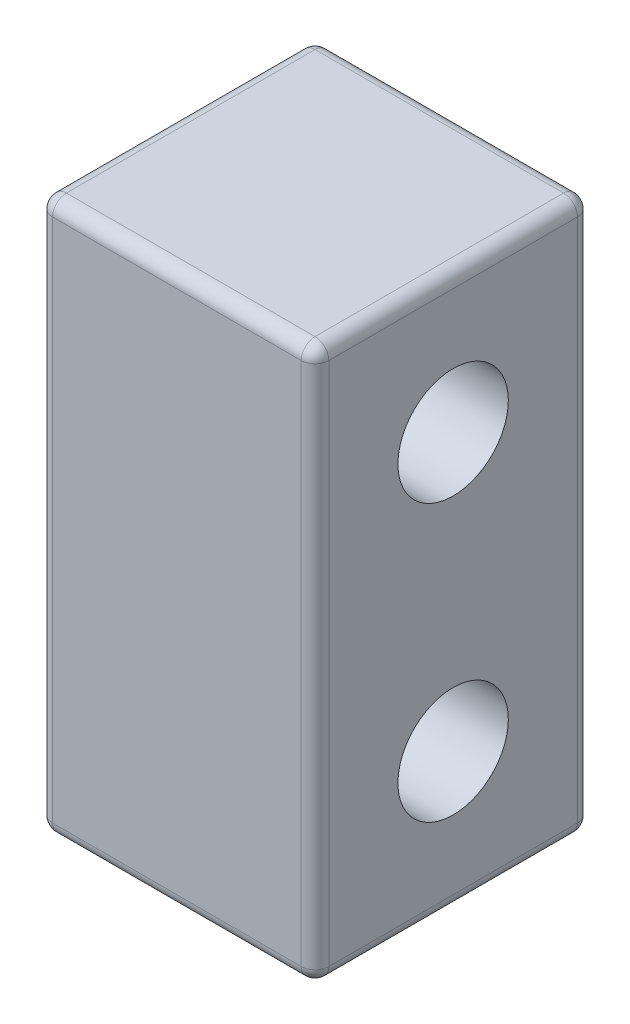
ISO-10303-21;
HEADER;
FILE_DESCRIPTION(('STEP AP214'),'2;1');
FILE_NAME('part.step','',(''),(''),'','','');
FILE_SCHEMA(('AUTOMOTIVE_DESIGN { 1 0 10303 214 1 1 1 1 }'));
ENDSEC;
DATA;
#1=APPLICATION_CONTEXT('core data for automotive mechanical design processes');
#2=APPLICATION_PROTOCOL_DEFINITION('international standard','automotive_design',2000,#1);
#3=PRODUCT_CONTEXT('',#1,'mechanical');
#4=PRODUCT('Part','Part','',(#3));
#5=PRODUCT_RELATED_PRODUCT_CATEGORY('part','',(#4));
#6=PRODUCT_DEFINITION_FORMATION('','',#4);
#7=PRODUCT_DEFINITION_CONTEXT('part definition',#1,'design');
#8=PRODUCT_DEFINITION('design','',#6,#7);
#9=PRODUCT_DEFINITION_SHAPE('','',#8);
#10=(LENGTH_UNIT() NAMED_UNIT(*) SI_UNIT(.MILLI.,.METRE.));
#11=(NAMED_UNIT(*) PLANE_ANGLE_UNIT() SI_UNIT($,.RADIAN.));
#12=(NAMED_UNIT(*) SI_UNIT($,.STERADIAN.) SOLID_ANGLE_UNIT());
#13=UNCERTAINTY_MEASURE_WITH_UNIT(LENGTH_MEASURE(1.E-05),#10,'distance_accuracy_value','');
#14=(GEOMETRIC_REPRESENTATION_CONTEXT(3) GLOBAL_UNCERTAINTY_ASSIGNED_CONTEXT((#13)) GLOBAL_UNIT_ASSIGNED_CONTEXT((#10,
#11,#12)) REPRESENTATION_CONTEXT('',''));
#15=CARTESIAN_POINT('',(0.,0.,0.));
#16=DIRECTION('',(0.,0.,1.));
#17=DIRECTION('',(1.,0.,0.));
#18=AXIS2_PLACEMENT_3D('',#15,#16,#17);
#19=CARTESIAN_POINT('',(50.8,50.8,25.4));
#20=DIRECTION('',(0.,0.,-1.));
#21=DIRECTION('',(0.,1.,0.));
#22=AXIS2_PLACEMENT_3D('',#19,#20,#21);
#23=PLANE('',#22);
#24=DIRECTION('',(0.,-1.,0.));
#25=VECTOR('',#24,1.);
#26=CARTESIAN_POINT('',(2.54,50.8,25.4));
#27=LINE('',#26,#25);
#28=CARTESIAN_POINT('',(2.54,48.26,25.4));
#29=VERTEX_POINT('',#28);
#30=CARTESIAN_POINT('',(2.54,-48.26,25.4));
#31=VERTEX_POINT('',#30);
#32=EDGE_CURVE('E177',#29,#31,#27,.T.);
#33=ORIENTED_EDGE('',*,*,#32,.T.);
#34=DIRECTION('',(-1.,0.,0.));
#35=VECTOR('',#34,1.);
#36=CARTESIAN_POINT('',(50.8,-48.26,25.4));
#37=LINE('',#36,#35);
#38=CARTESIAN_POINT('',(48.26,-48.26,25.4));
#39=VERTEX_POINT('',#38);
#40=EDGE_CURVE('E182',#31,#39,#37,.F.);
#41=ORIENTED_EDGE('',*,*,#40,.T.);
#42=DIRECTION('',(0.,-1.,0.));
#43=VECTOR('',#42,1.);
#44=CARTESIAN_POINT('',(48.26,50.8,25.4));
#45=LINE('',#44,#43);
#46=CARTESIAN_POINT('',(48.26,48.26,25.4));
#47=VERTEX_POINT('',#46);
#48=EDGE_CURVE('E179',#39,#47,#45,.F.);
#49=ORIENTED_EDGE('',*,*,#48,.T.);
#50=DIRECTION('',(-1.,0.,0.));
#51=VECTOR('',#50,1.);
#52=CARTESIAN_POINT('',(50.8,48.26,25.4));
#53=LINE('',#52,#51);
#54=EDGE_CURVE('E175',#47,#29,#53,.T.);
#55=ORIENTED_EDGE('',*,*,#54,.T.);
#56=EDGE_LOOP('',(#33,#41,#49,#55));
#57=FACE_BOUND('',#56,.T.);
#58=ADVANCED_FACE('F30',(#57),#23,.F.);
#59=CARTESIAN_POINT('',(50.8,-50.8,25.4));
#60=DIRECTION('',(0.,1.,0.));
#61=DIRECTION('',(0.,0.,1.));
#62=AXIS2_PLACEMENT_3D('',#59,#60,#61);
#63=PLANE('',#62);
#64=DIRECTION('',(0.,0.,-1.));
#65=VECTOR('',#64,1.);
#66=CARTESIAN_POINT('',(48.26,-50.8,25.4));
#67=LINE('',#66,#65);
#68=CARTESIAN_POINT('',(48.26,-50.8,-22.86));
#69=VERTEX_POINT('',#68);
#70=CARTESIAN_POINT('',(48.26,-50.8,22.86));
#71=VERTEX_POINT('',#70);
#72=EDGE_CURVE('E188',#69,#71,#67,.F.);
#73=ORIENTED_EDGE('',*,*,#72,.T.);
#74=DIRECTION('',(-1.,0.,0.));
#75=VECTOR('',#74,1.);
#76=CARTESIAN_POINT('',(50.8,-50.8,22.86));
#77=LINE('',#76,#75);
#78=CARTESIAN_POINT('',(2.54,-50.8,22.86));
#79=VERTEX_POINT('',#78);
#80=EDGE_CURVE('E190',#71,#79,#77,.T.);
#81=ORIENTED_EDGE('',*,*,#80,.T.);
#82=DIRECTION('',(0.,0.,-1.));
#83=VECTOR('',#82,1.);
#84=CARTESIAN_POINT('',(2.54,-50.8,25.4));
#85=LINE('',#84,#83);
#86=CARTESIAN_POINT('',(2.54,-50.8,-22.86));
#87=VERTEX_POINT('',#86);
#88=EDGE_CURVE('E184',#79,#87,#85,.T.);
#89=ORIENTED_EDGE('',*,*,#88,.T.);
#90=DIRECTION('',(-1.,0.,0.));
#91=VECTOR('',#90,1.);
#92=CARTESIAN_POINT('',(50.8,-50.8,-22.86));
#93=LINE('',#92,#91);
#94=EDGE_CURVE('E186',#87,#69,#93,.F.);
#95=ORIENTED_EDGE('',*,*,#94,.T.);
#96=EDGE_LOOP('',(#73,#81,#89,#95));
#97=FACE_BOUND('',#96,.T.);
#98=ADVANCED_FACE('F288',(#97),#63,.F.);
#99=CARTESIAN_POINT('',(50.8,50.8,-25.4));
#100=DIRECTION('',(0.,0.,1.));
#101=DIRECTION('',(0.,-1.,0.));
#102=AXIS2_PLACEMENT_3D('',#99,#100,#101);
#103=PLANE('',#102);
#104=DIRECTION('',(0.,1.,0.));
#105=VECTOR('',#104,1.);
#106=CARTESIAN_POINT('',(48.26,-50.8,-25.4));
#107=LINE('',#106,#105);
#108=CARTESIAN_POINT('',(48.26,48.26,-25.4));
#109=VERTEX_POINT('',#108);
#110=CARTESIAN_POINT('',(48.26,-48.26,-25.4));
#111=VERTEX_POINT('',#110);
#112=EDGE_CURVE('E126',#109,#111,#107,.F.);
#113=ORIENTED_EDGE('',*,*,#112,.T.);
#114=DIRECTION('',(-1.,0.,0.));
#115=VECTOR('',#114,1.);
#116=CARTESIAN_POINT('',(50.8,-48.26,-25.4));
#117=LINE('',#116,#115);
#118=CARTESIAN_POINT('',(2.54,-48.26,-25.4));
#119=VERTEX_POINT('',#118);
#120=EDGE_CURVE('E164',#111,#119,#117,.T.);
#121=ORIENTED_EDGE('',*,*,#120,.T.);
#122=DIRECTION('',(0.,1.,0.));
#123=VECTOR('',#122,1.);
#124=CARTESIAN_POINT('',(2.54,50.8,-25.4));
#125=LINE('',#124,#123);
#126=CARTESIAN_POINT('',(2.54,48.26,-25.4));
#127=VERTEX_POINT('',#126);
#128=EDGE_CURVE('E161',#119,#127,#125,.T.);
#129=ORIENTED_EDGE('',*,*,#128,.T.);
#130=DIRECTION('',(-1.,0.,0.));
#131=VECTOR('',#130,1.);
#132=CARTESIAN_POINT('',(50.8,48.26,-25.4));
#133=LINE('',#132,#131);
#134=EDGE_CURVE('E156',#127,#109,#133,.F.);
#135=ORIENTED_EDGE('',*,*,#134,.T.);
#136=EDGE_LOOP('',(#113,#121,#129,#135));
#137=FACE_BOUND('',#136,.T.);
#138=ADVANCED_FACE('F284',(#137),#103,.F.);
#139=CARTESIAN_POINT('',(50.8,50.8,25.4));
#140=DIRECTION('',(0.,-1.,0.));
#141=DIRECTION('',(0.,0.,-1.));
#142=AXIS2_PLACEMENT_3D('',#139,#140,#141);
#143=PLANE('',#142);
#144=DIRECTION('',(0.,0.,1.));
#145=VECTOR('',#144,1.);
#146=CARTESIAN_POINT('',(48.26,50.8,-25.4));
#147=LINE('',#146,#145);
#148=CARTESIAN_POINT('',(48.26,50.8,22.86));
#149=VERTEX_POINT('',#148);
#150=CARTESIAN_POINT('',(48.26,50.8,-22.86));
#151=VERTEX_POINT('',#150);
#152=EDGE_CURVE('E39',#149,#151,#147,.F.);
#153=ORIENTED_EDGE('',*,*,#152,.T.);
#154=DIRECTION('',(-1.,0.,0.));
#155=VECTOR('',#154,1.);
#156=CARTESIAN_POINT('',(50.8,50.8,-22.86));
#157=LINE('',#156,#155);
#158=CARTESIAN_POINT('',(2.54,50.8,-22.86));
#159=VERTEX_POINT('',#158);
#160=EDGE_CURVE('E11',#151,#159,#157,.T.);
#161=ORIENTED_EDGE('',*,*,#160,.T.);
#162=DIRECTION('',(0.,0.,1.));
#163=VECTOR('',#162,1.);
#164=CARTESIAN_POINT('',(2.54,50.8,25.4));
#165=LINE('',#164,#163);
#166=CARTESIAN_POINT('',(2.54,50.8,22.86));
#167=VERTEX_POINT('',#166);
#168=EDGE_CURVE('E193',#159,#167,#165,.T.);
#169=ORIENTED_EDGE('',*,*,#168,.T.);
#170=DIRECTION('',(-1.,0.,0.));
#171=VECTOR('',#170,1.);
#172=CARTESIAN_POINT('',(50.8,50.8,22.86));
#173=LINE('',#172,#171);
#174=EDGE_CURVE('E50',#167,#149,#173,.F.);
#175=ORIENTED_EDGE('',*,*,#174,.T.);
#176=EDGE_LOOP('',(#153,#161,#169,#175));
#177=FACE_BOUND('',#176,.T.);
#178=ADVANCED_FACE('F276',(#177),#143,.F.);
#179=CARTESIAN_POINT('',(50.8,50.8,25.4));
#180=DIRECTION('',(1.,0.,0.));
#181=DIRECTION('',(0.,0.,-1.));
#182=AXIS2_PLACEMENT_3D('',#179,#180,#181);
#183=PLANE('',#182);
#184=DIRECTION('',(0.,-1.,0.));
#185=VECTOR('',#184,1.);
#186=CARTESIAN_POINT('',(50.8,-50.8,22.86));
#187=LINE('',#186,#185);
#188=CARTESIAN_POINT('',(50.8,48.26,22.86));
#189=VERTEX_POINT('',#188);
#190=CARTESIAN_POINT('',(50.8,-48.26,22.86));
#191=VERTEX_POINT('',#190);
#192=EDGE_CURVE('E147',#189,#191,#187,.T.);
#193=ORIENTED_EDGE('',*,*,#192,.T.);
#194=DIRECTION('',(0.,0.,-1.));
#195=VECTOR('',#194,1.);
#196=CARTESIAN_POINT('',(50.8,-48.26,-25.4));
#197=LINE('',#196,#195);
#198=CARTESIAN_POINT('',(50.8,-48.26,-22.86));
#199=VERTEX_POINT('',#198);
#200=EDGE_CURVE('E153',#191,#199,#197,.T.);
#201=ORIENTED_EDGE('',*,*,#200,.T.);
#202=DIRECTION('',(0.,1.,0.));
#203=VECTOR('',#202,1.);
#204=CARTESIAN_POINT('',(50.8,50.8,-22.86));
#205=LINE('',#204,#203);
#206=CARTESIAN_POINT('',(50.8,48.26,-22.86));
#207=VERTEX_POINT('',#206);
#208=EDGE_CURVE('E124',#199,#207,#205,.T.);
#209=ORIENTED_EDGE('',*,*,#208,.T.);
#210=DIRECTION('',(0.,0.,1.));
#211=VECTOR('',#210,1.);
#212=CARTESIAN_POINT('',(50.8,48.26,25.4));
#213=LINE('',#212,#211);
#214=EDGE_CURVE('E141',#207,#189,#213,.T.);
#215=ORIENTED_EDGE('',*,*,#214,.T.);
#216=EDGE_LOOP('',(#193,#201,#209,#215));
#217=FACE_BOUND('',#216,.T.);
#218=CARTESIAN_POINT('',(50.8,-25.4,0.));
#219=DIRECTION('',(1.,0.,0.));
#220=DIRECTION('',(0.,0.,-1.));
#221=AXIS2_PLACEMENT_3D('',#218,#219,#220);
#222=CIRCLE('',#221,10.1506878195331);
#223=CARTESIAN_POINT('',(50.8,-25.4,-10.1506878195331));
#224=VERTEX_POINT('',#223);
#225=EDGE_CURVE('E253',#224,#224,#222,.T.);
#226=ORIENTED_EDGE('',*,*,#225,.F.);
#227=EDGE_LOOP('',(#226));
#228=FACE_BOUND('',#227,.T.);
#229=CARTESIAN_POINT('',(50.8,25.4,0.));
#230=DIRECTION('',(1.,0.,0.));
#231=DIRECTION('',(0.,0.,-1.));
#232=AXIS2_PLACEMENT_3D('',#229,#230,#231);
#233=CIRCLE('',#232,10.1506878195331);
#234=CARTESIAN_POINT('',(50.8,25.4,-10.1506878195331));
#235=VERTEX_POINT('',#234);
#236=EDGE_CURVE('E264',#235,#235,#233,.T.);
#237=ORIENTED_EDGE('',*,*,#236,.F.);
#238=EDGE_LOOP('',(#237));
#239=FACE_BOUND('',#238,.T.);
#240=ADVANCED_FACE('F150',(#217,#228,#239),#183,.T.);
#241=CARTESIAN_POINT('',(0.,50.8,25.4));
#242=DIRECTION('',(1.,0.,0.));
#243=DIRECTION('',(0.,0.,-1.));
#244=AXIS2_PLACEMENT_3D('',#241,#242,#243);
#245=PLANE('',#244);
#246=DIRECTION('',(0.,1.,0.));
#247=VECTOR('',#246,1.);
#248=CARTESIAN_POINT('',(0.,50.8,-22.86));
#249=LINE('',#248,#247);
#250=CARTESIAN_POINT('',(0.,48.26,-22.86));
#251=VERTEX_POINT('',#250);
#252=CARTESIAN_POINT('',(0.,-48.26,-22.86));
#253=VERTEX_POINT('',#252);
#254=EDGE_CURVE('E170',#251,#253,#249,.F.);
#255=ORIENTED_EDGE('',*,*,#254,.T.);
#256=DIRECTION('',(0.,0.,-1.));
#257=VECTOR('',#256,1.);
#258=CARTESIAN_POINT('',(0.,-48.26,25.4));
#259=LINE('',#258,#257);
#260=CARTESIAN_POINT('',(0.,-48.26,22.86));
#261=VERTEX_POINT('',#260);
#262=EDGE_CURVE('E173',#253,#261,#259,.F.);
#263=ORIENTED_EDGE('',*,*,#262,.T.);
#264=DIRECTION('',(0.,-1.,0.));
#265=VECTOR('',#264,1.);
#266=CARTESIAN_POINT('',(0.,50.8,22.86));
#267=LINE('',#266,#265);
#268=CARTESIAN_POINT('',(0.,48.26,22.86));
#269=VERTEX_POINT('',#268);
#270=EDGE_CURVE('E168',#261,#269,#267,.F.);
#271=ORIENTED_EDGE('',*,*,#270,.T.);
#272=DIRECTION('',(0.,0.,1.));
#273=VECTOR('',#272,1.);
#274=CARTESIAN_POINT('',(0.,48.26,25.4));
#275=LINE('',#274,#273);
#276=EDGE_CURVE('E166',#269,#251,#275,.F.);
#277=ORIENTED_EDGE('',*,*,#276,.T.);
#278=EDGE_LOOP('',(#255,#263,#271,#277));
#279=FACE_BOUND('',#278,.T.);
#280=ADVANCED_FACE('F275',(#279),#245,.F.);
#281=CARTESIAN_POINT('',(25.4,25.4,0.));
#282=DIRECTION('',(1.,0.,0.));
#283=DIRECTION('',(0.,0.,-1.));
#284=AXIS2_PLACEMENT_3D('',#281,#282,#283);
#285=CYLINDRICAL_SURFACE('',#284,10.1506878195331);
#286=CARTESIAN_POINT('',(25.4,25.4,0.));
#287=DIRECTION('',(1.,0.,0.));
#288=DIRECTION('',(0.,0.,-1.));
#289=AXIS2_PLACEMENT_3D('',#286,#287,#288);
#290=CIRCLE('',#289,10.1506878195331);
#291=CARTESIAN_POINT('',(25.4,25.4,-10.1506878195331));
#292=VERTEX_POINT('',#291);
#293=EDGE_CURVE('E148',#292,#292,#290,.T.);
#294=ORIENTED_EDGE('',*,*,#293,.F.);
#295=EDGE_LOOP('',(#294));
#296=FACE_BOUND('',#295,.T.);
#297=ORIENTED_EDGE('',*,*,#236,.T.);
#298=EDGE_LOOP('',(#297));
#299=FACE_BOUND('',#298,.T.);
#300=ADVANCED_FACE('F272',(#296,#299),#285,.F.);
#301=CARTESIAN_POINT('',(25.4,25.4,0.));
#302=DIRECTION('',(1.,0.,0.));
#303=DIRECTION('',(0.,0.,-1.));
#304=AXIS2_PLACEMENT_3D('',#301,#302,#303);
#305=PLANE('',#304);
#306=ORIENTED_EDGE('',*,*,#293,.T.);
#307=EDGE_LOOP('',(#306));
#308=FACE_BOUND('',#307,.T.);
#309=ADVANCED_FACE('F552',(#308),#305,.T.);
#310=CARTESIAN_POINT('',(25.4,-25.4,0.));
#311=DIRECTION('',(1.,0.,0.));
#312=DIRECTION('',(0.,0.,-1.));
#313=AXIS2_PLACEMENT_3D('',#310,#311,#312);
#314=CYLINDRICAL_SURFACE('',#313,10.1506878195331);
#315=CARTESIAN_POINT('',(25.4,-25.4,0.));
#316=DIRECTION('',(1.,0.,0.));
#317=DIRECTION('',(0.,0.,-1.));
#318=AXIS2_PLACEMENT_3D('',#315,#316,#317);
#319=CIRCLE('',#318,10.1506878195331);
#320=CARTESIAN_POINT('',(25.4,-25.4,-10.1506878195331));
#321=VERTEX_POINT('',#320);
#322=EDGE_CURVE('E259',#321,#321,#319,.T.);
#323=ORIENTED_EDGE('',*,*,#322,.F.);
#324=EDGE_LOOP('',(#323));
#325=FACE_BOUND('',#324,.T.);
#326=ORIENTED_EDGE('',*,*,#225,.T.);
#327=EDGE_LOOP('',(#326));
#328=FACE_BOUND('',#327,.T.);
#329=ADVANCED_FACE('F544',(#325,#328),#314,.F.);
#330=CARTESIAN_POINT('',(25.4,-25.4,0.));
#331=DIRECTION('',(1.,0.,0.));
#332=DIRECTION('',(0.,0.,-1.));
#333=AXIS2_PLACEMENT_3D('',#330,#331,#332);
#334=PLANE('',#333);
#335=ORIENTED_EDGE('',*,*,#322,.T.);
#336=EDGE_LOOP('',(#335));
#337=FACE_BOUND('',#336,.T.);
#338=ADVANCED_FACE('F367',(#337),#334,.T.);
#339=CARTESIAN_POINT('',(2.54,50.8,22.86));
#340=DIRECTION('',(0.,-1.,0.));
#341=DIRECTION('',(0.,0.,-1.));
#342=AXIS2_PLACEMENT_3D('',#339,#340,#341);
#343=CYLINDRICAL_SURFACE('',#342,2.54);
#344=CARTESIAN_POINT('',(2.54,-48.26,22.86));
#345=DIRECTION('',(0.,-1.,0.));
#346=DIRECTION('',(0.,0.,-1.));
#347=AXIS2_PLACEMENT_3D('',#344,#345,#346);
#348=CIRCLE('',#347,2.54);
#349=EDGE_CURVE('E34',#31,#261,#348,.T.);
#350=ORIENTED_EDGE('',*,*,#349,.F.);
#351=ORIENTED_EDGE('',*,*,#32,.F.);
#352=CARTESIAN_POINT('',(2.54,48.26,22.86));
#353=DIRECTION('',(0.,1.,0.));
#354=DIRECTION('',(0.,0.,1.));
#355=AXIS2_PLACEMENT_3D('',#352,#353,#354);
#356=CIRCLE('',#355,2.54);
#357=EDGE_CURVE('E246',#269,#29,#356,.T.);
#358=ORIENTED_EDGE('',*,*,#357,.F.);
#359=ORIENTED_EDGE('',*,*,#270,.F.);
#360=EDGE_LOOP('',(#350,#351,#358,#359));
#361=FACE_BOUND('',#360,.T.);
#362=ADVANCED_FACE('F32',(#361),#343,.T.);
#363=CARTESIAN_POINT('',(2.54,-48.26,22.86));
#364=DIRECTION('',(0.,0.,1.));
#365=DIRECTION('',(1.,0.,0.));
#366=AXIS2_PLACEMENT_3D('',#363,#364,#365);
#367=SPHERICAL_SURFACE('',#366,2.54);
#368=CARTESIAN_POINT('',(2.54,-48.26,22.86));
#369=DIRECTION('',(-1.,0.,0.));
#370=DIRECTION('',(0.,0.,1.));
#371=AXIS2_PLACEMENT_3D('',#368,#369,#370);
#372=CIRCLE('',#371,2.54);
#373=EDGE_CURVE('E241',#31,#79,#372,.F.);
#374=ORIENTED_EDGE('',*,*,#373,.F.);
#375=ORIENTED_EDGE('',*,*,#349,.T.);
#376=CARTESIAN_POINT('',(2.54,-48.26,22.86));
#377=DIRECTION('',(0.,0.,1.));
#378=DIRECTION('',(1.,0.,0.));
#379=AXIS2_PLACEMENT_3D('',#376,#377,#378);
#380=CIRCLE('',#379,2.54);
#381=EDGE_CURVE('E244',#79,#261,#380,.F.);
#382=ORIENTED_EDGE('',*,*,#381,.F.);
#383=EDGE_LOOP('',(#374,#375,#382));
#384=FACE_BOUND('',#383,.T.);
#385=ADVANCED_FACE('F362',(#384),#367,.T.);
#386=CARTESIAN_POINT('',(2.54,48.26,22.86));
#387=DIRECTION('',(0.,0.,1.));
#388=DIRECTION('',(1.,0.,0.));
#389=AXIS2_PLACEMENT_3D('',#386,#387,#388);
#390=SPHERICAL_SURFACE('',#389,2.54);
#391=CARTESIAN_POINT('',(2.54,48.26,22.86));
#392=DIRECTION('',(0.,0.,1.));
#393=DIRECTION('',(1.,0.,0.));
#394=AXIS2_PLACEMENT_3D('',#391,#392,#393);
#395=CIRCLE('',#394,2.54);
#396=EDGE_CURVE('E235',#269,#167,#395,.F.);
#397=ORIENTED_EDGE('',*,*,#396,.F.);
#398=ORIENTED_EDGE('',*,*,#357,.T.);
#399=CARTESIAN_POINT('',(2.54,48.26,22.86));
#400=DIRECTION('',(-1.,0.,0.));
#401=DIRECTION('',(0.,0.,1.));
#402=AXIS2_PLACEMENT_3D('',#399,#400,#401);
#403=CIRCLE('',#402,2.54);
#404=EDGE_CURVE('E238',#167,#29,#403,.F.);
#405=ORIENTED_EDGE('',*,*,#404,.F.);
#406=EDGE_LOOP('',(#397,#398,#405));
#407=FACE_BOUND('',#406,.T.);
#408=ADVANCED_FACE('F359',(#407),#390,.T.);
#409=CARTESIAN_POINT('',(2.54,-48.26,25.4));
#410=DIRECTION('',(0.,0.,-1.));
#411=DIRECTION('',(-1.,0.,0.));
#412=AXIS2_PLACEMENT_3D('',#409,#410,#411);
#413=CYLINDRICAL_SURFACE('',#412,2.54);
#414=ORIENTED_EDGE('',*,*,#381,.T.);
#415=ORIENTED_EDGE('',*,*,#262,.F.);
#416=CARTESIAN_POINT('',(2.54,-48.26,-22.86));
#417=DIRECTION('',(0.,0.,-1.));
#418=DIRECTION('',(-1.,0.,0.));
#419=AXIS2_PLACEMENT_3D('',#416,#417,#418);
#420=CIRCLE('',#419,2.54);
#421=EDGE_CURVE('E230',#87,#253,#420,.T.);
#422=ORIENTED_EDGE('',*,*,#421,.F.);
#423=ORIENTED_EDGE('',*,*,#88,.F.);
#424=EDGE_LOOP('',(#414,#415,#422,#423));
#425=FACE_BOUND('',#424,.T.);
#426=ADVANCED_FACE('F355',(#425),#413,.T.);
#427=CARTESIAN_POINT('',(50.8,-48.26,22.86));
#428=DIRECTION('',(-1.,0.,0.));
#429=DIRECTION('',(0.,0.,1.));
#430=AXIS2_PLACEMENT_3D('',#427,#428,#429);
#431=CYLINDRICAL_SURFACE('',#430,2.54);
#432=ORIENTED_EDGE('',*,*,#373,.T.);
#433=ORIENTED_EDGE('',*,*,#80,.F.);
#434=CARTESIAN_POINT('',(48.26,-48.26,22.86));
#435=DIRECTION('',(1.,0.,0.));
#436=DIRECTION('',(0.,0.,-1.));
#437=AXIS2_PLACEMENT_3D('',#434,#435,#436);
#438=CIRCLE('',#437,2.54);
#439=EDGE_CURVE('E227',#39,#71,#438,.T.);
#440=ORIENTED_EDGE('',*,*,#439,.F.);
#441=ORIENTED_EDGE('',*,*,#40,.F.);
#442=EDGE_LOOP('',(#432,#433,#440,#441));
#443=FACE_BOUND('',#442,.T.);
#444=ADVANCED_FACE('F351',(#443),#431,.T.);
#445=CARTESIAN_POINT('',(48.26,50.8,22.86));
#446=DIRECTION('',(0.,1.,0.));
#447=DIRECTION('',(0.,0.,1.));
#448=AXIS2_PLACEMENT_3D('',#445,#446,#447);
#449=CYLINDRICAL_SURFACE('',#448,2.54);
#450=CARTESIAN_POINT('',(48.26,48.26,22.86));
#451=DIRECTION('',(0.,1.,0.));
#452=DIRECTION('',(0.,0.,1.));
#453=AXIS2_PLACEMENT_3D('',#450,#451,#452);
#454=CIRCLE('',#453,2.54);
#455=EDGE_CURVE('E221',#47,#189,#454,.T.);
#456=ORIENTED_EDGE('',*,*,#455,.F.);
#457=ORIENTED_EDGE('',*,*,#48,.F.);
#458=CARTESIAN_POINT('',(48.26,-48.26,22.86));
#459=DIRECTION('',(0.,-1.,0.));
#460=DIRECTION('',(0.,0.,-1.));
#461=AXIS2_PLACEMENT_3D('',#458,#459,#460);
#462=CIRCLE('',#461,2.54);
#463=EDGE_CURVE('E224',#191,#39,#462,.T.);
#464=ORIENTED_EDGE('',*,*,#463,.F.);
#465=ORIENTED_EDGE('',*,*,#192,.F.);
#466=EDGE_LOOP('',(#456,#457,#464,#465));
#467=FACE_BOUND('',#466,.T.);
#468=ADVANCED_FACE('F347',(#467),#449,.T.);
#469=CARTESIAN_POINT('',(50.8,48.26,22.86));
#470=DIRECTION('',(-1.,0.,0.));
#471=DIRECTION('',(0.,0.,1.));
#472=AXIS2_PLACEMENT_3D('',#469,#470,#471);
#473=CYLINDRICAL_SURFACE('',#472,2.54);
#474=ORIENTED_EDGE('',*,*,#404,.T.);
#475=ORIENTED_EDGE('',*,*,#54,.F.);
#476=CARTESIAN_POINT('',(48.26,48.26,22.86));
#477=DIRECTION('',(1.,0.,0.));
#478=DIRECTION('',(0.,0.,-1.));
#479=AXIS2_PLACEMENT_3D('',#476,#477,#478);
#480=CIRCLE('',#479,2.54);
#481=EDGE_CURVE('E219',#149,#47,#480,.T.);
#482=ORIENTED_EDGE('',*,*,#481,.F.);
#483=ORIENTED_EDGE('',*,*,#174,.F.);
#484=EDGE_LOOP('',(#474,#475,#482,#483));
#485=FACE_BOUND('',#484,.T.);
#486=ADVANCED_FACE('F343',(#485),#473,.T.);
#487=CARTESIAN_POINT('',(2.54,48.26,25.4));
#488=DIRECTION('',(0.,0.,1.));
#489=DIRECTION('',(0.,-1.,0.));
#490=AXIS2_PLACEMENT_3D('',#487,#488,#489);
#491=CYLINDRICAL_SURFACE('',#490,2.54);
#492=ORIENTED_EDGE('',*,*,#396,.T.);
#493=ORIENTED_EDGE('',*,*,#168,.F.);
#494=CARTESIAN_POINT('',(2.54,48.26,-22.86));
#495=DIRECTION('',(0.,0.,-1.));
#496=DIRECTION('',(-1.,0.,0.));
#497=AXIS2_PLACEMENT_3D('',#494,#495,#496);
#498=CIRCLE('',#497,2.54);
#499=EDGE_CURVE('E216',#251,#159,#498,.T.);
#500=ORIENTED_EDGE('',*,*,#499,.F.);
#501=ORIENTED_EDGE('',*,*,#276,.F.);
#502=EDGE_LOOP('',(#492,#493,#500,#501));
#503=FACE_BOUND('',#502,.T.);
#504=ADVANCED_FACE('F339',(#503),#491,.T.);
#505=CARTESIAN_POINT('',(2.54,50.8,-22.86));
#506=DIRECTION('',(0.,1.,0.));
#507=DIRECTION('',(0.,0.,1.));
#508=AXIS2_PLACEMENT_3D('',#505,#506,#507);
#509=CYLINDRICAL_SURFACE('',#508,2.54);
#510=CARTESIAN_POINT('',(2.54,-48.26,-22.86));
#511=DIRECTION('',(0.,-1.,0.));
#512=DIRECTION('',(0.,0.,-1.));
#513=AXIS2_PLACEMENT_3D('',#510,#511,#512);
#514=CIRCLE('',#513,2.54);
#515=EDGE_CURVE('E232',#253,#119,#514,.T.);
#516=ORIENTED_EDGE('',*,*,#515,.F.);
#517=ORIENTED_EDGE('',*,*,#254,.F.);
#518=CARTESIAN_POINT('',(2.54,48.26,-22.86));
#519=DIRECTION('',(0.,1.,0.));
#520=DIRECTION('',(0.,0.,1.));
#521=AXIS2_PLACEMENT_3D('',#518,#519,#520);
#522=CIRCLE('',#521,2.54);
#523=EDGE_CURVE('E213',#127,#251,#522,.T.);
#524=ORIENTED_EDGE('',*,*,#523,.F.);
#525=ORIENTED_EDGE('',*,*,#128,.F.);
#526=EDGE_LOOP('',(#516,#517,#524,#525));
#527=FACE_BOUND('',#526,.T.);
#528=ADVANCED_FACE('F335',(#527),#509,.T.);
#529=CARTESIAN_POINT('',(2.54,-48.26,-22.86));
#530=DIRECTION('',(0.,0.,1.));
#531=DIRECTION('',(1.,0.,0.));
#532=AXIS2_PLACEMENT_3D('',#529,#530,#531);
#533=SPHERICAL_SURFACE('',#532,2.54);
#534=ORIENTED_EDGE('',*,*,#421,.T.);
#535=ORIENTED_EDGE('',*,*,#515,.T.);
#536=CARTESIAN_POINT('',(2.54,-48.26,-22.86));
#537=DIRECTION('',(-1.,0.,0.));
#538=DIRECTION('',(0.,0.,1.));
#539=AXIS2_PLACEMENT_3D('',#536,#537,#538);
#540=CIRCLE('',#539,2.54);
#541=EDGE_CURVE('E210',#87,#119,#540,.F.);
#542=ORIENTED_EDGE('',*,*,#541,.F.);
#543=EDGE_LOOP('',(#534,#535,#542));
#544=FACE_BOUND('',#543,.T.);
#545=ADVANCED_FACE('F331',(#544),#533,.T.);
#546=CARTESIAN_POINT('',(48.26,-48.26,22.86));
#547=DIRECTION('',(0.,0.,1.));
#548=DIRECTION('',(1.,0.,0.));
#549=AXIS2_PLACEMENT_3D('',#546,#547,#548);
#550=SPHERICAL_SURFACE('',#549,2.54);
#551=ORIENTED_EDGE('',*,*,#463,.T.);
#552=ORIENTED_EDGE('',*,*,#439,.T.);
#553=CARTESIAN_POINT('',(48.26,-48.26,22.86));
#554=DIRECTION('',(0.,0.,1.));
#555=DIRECTION('',(1.,0.,0.));
#556=AXIS2_PLACEMENT_3D('',#553,#554,#555);
#557=CIRCLE('',#556,2.54);
#558=EDGE_CURVE('E207',#191,#71,#557,.F.);
#559=ORIENTED_EDGE('',*,*,#558,.F.);
#560=EDGE_LOOP('',(#551,#552,#559));
#561=FACE_BOUND('',#560,.T.);
#562=ADVANCED_FACE('F327',(#561),#550,.T.);
#563=CARTESIAN_POINT('',(48.26,48.26,22.86));
#564=DIRECTION('',(0.,0.,1.));
#565=DIRECTION('',(1.,0.,0.));
#566=AXIS2_PLACEMENT_3D('',#563,#564,#565);
#567=SPHERICAL_SURFACE('',#566,2.54);
#568=ORIENTED_EDGE('',*,*,#481,.T.);
#569=ORIENTED_EDGE('',*,*,#455,.T.);
#570=CARTESIAN_POINT('',(48.26,48.26,22.86));
#571=DIRECTION('',(0.,0.,1.));
#572=DIRECTION('',(1.,0.,0.));
#573=AXIS2_PLACEMENT_3D('',#570,#571,#572);
#574=CIRCLE('',#573,2.54);
#575=EDGE_CURVE('E144',#149,#189,#574,.F.);
#576=ORIENTED_EDGE('',*,*,#575,.F.);
#577=EDGE_LOOP('',(#568,#569,#576));
#578=FACE_BOUND('',#577,.T.);
#579=ADVANCED_FACE('F323',(#578),#567,.T.);
#580=CARTESIAN_POINT('',(2.54,48.26,-22.86));
#581=DIRECTION('',(0.,0.,1.));
#582=DIRECTION('',(1.,0.,0.));
#583=AXIS2_PLACEMENT_3D('',#580,#581,#582);
#584=SPHERICAL_SURFACE('',#583,2.54);
#585=ORIENTED_EDGE('',*,*,#523,.T.);
#586=ORIENTED_EDGE('',*,*,#499,.T.);
#587=CARTESIAN_POINT('',(2.54,48.26,-22.86));
#588=DIRECTION('',(-1.,0.,0.));
#589=DIRECTION('',(0.,0.,1.));
#590=AXIS2_PLACEMENT_3D('',#587,#588,#589);
#591=CIRCLE('',#590,2.54);
#592=EDGE_CURVE('E204',#127,#159,#591,.F.);
#593=ORIENTED_EDGE('',*,*,#592,.F.);
#594=EDGE_LOOP('',(#585,#586,#593));
#595=FACE_BOUND('',#594,.T.);
#596=ADVANCED_FACE('F319',(#595),#584,.T.);
#597=CARTESIAN_POINT('',(50.8,-48.26,-22.86));
#598=DIRECTION('',(-1.,0.,0.));
#599=DIRECTION('',(0.,0.,1.));
#600=AXIS2_PLACEMENT_3D('',#597,#598,#599);
#601=CYLINDRICAL_SURFACE('',#600,2.54);
#602=ORIENTED_EDGE('',*,*,#541,.T.);
#603=ORIENTED_EDGE('',*,*,#120,.F.);
#604=CARTESIAN_POINT('',(48.26,-48.26,-22.86));
#605=DIRECTION('',(1.,0.,0.));
#606=DIRECTION('',(0.,0.,-1.));
#607=AXIS2_PLACEMENT_3D('',#604,#605,#606);
#608=CIRCLE('',#607,2.54);
#609=EDGE_CURVE('E201',#69,#111,#608,.T.);
#610=ORIENTED_EDGE('',*,*,#609,.F.);
#611=ORIENTED_EDGE('',*,*,#94,.F.);
#612=EDGE_LOOP('',(#602,#603,#610,#611));
#613=FACE_BOUND('',#612,.T.);
#614=ADVANCED_FACE('F315',(#613),#601,.T.);
#615=CARTESIAN_POINT('',(48.26,-48.26,25.4));
#616=DIRECTION('',(0.,0.,1.));
#617=DIRECTION('',(1.,0.,0.));
#618=AXIS2_PLACEMENT_3D('',#615,#616,#617);
#619=CYLINDRICAL_SURFACE('',#618,2.54);
#620=ORIENTED_EDGE('',*,*,#558,.T.);
#621=ORIENTED_EDGE('',*,*,#72,.F.);
#622=CARTESIAN_POINT('',(48.26,-48.26,-22.86));
#623=DIRECTION('',(0.,0.,-1.));
#624=DIRECTION('',(-1.,0.,0.));
#625=AXIS2_PLACEMENT_3D('',#622,#623,#624);
#626=CIRCLE('',#625,2.54);
#627=EDGE_CURVE('E138',#199,#69,#626,.T.);
#628=ORIENTED_EDGE('',*,*,#627,.F.);
#629=ORIENTED_EDGE('',*,*,#200,.F.);
#630=EDGE_LOOP('',(#620,#621,#628,#629));
#631=FACE_BOUND('',#630,.T.);
#632=ADVANCED_FACE('F312',(#631),#619,.T.);
#633=CARTESIAN_POINT('',(48.26,48.26,25.4));
#634=DIRECTION('',(0.,0.,-1.));
#635=DIRECTION('',(0.,1.,0.));
#636=AXIS2_PLACEMENT_3D('',#633,#634,#635);
#637=CYLINDRICAL_SURFACE('',#636,2.54);
#638=ORIENTED_EDGE('',*,*,#575,.T.);
#639=ORIENTED_EDGE('',*,*,#214,.F.);
#640=CARTESIAN_POINT('',(48.26,48.26,-22.86));
#641=DIRECTION('',(0.,0.,-1.));
#642=DIRECTION('',(-1.,0.,0.));
#643=AXIS2_PLACEMENT_3D('',#640,#641,#642);
#644=CIRCLE('',#643,2.54);
#645=EDGE_CURVE('E132',#151,#207,#644,.T.);
#646=ORIENTED_EDGE('',*,*,#645,.F.);
#647=ORIENTED_EDGE('',*,*,#152,.F.);
#648=EDGE_LOOP('',(#638,#639,#646,#647));
#649=FACE_BOUND('',#648,.T.);
#650=ADVANCED_FACE('F142',(#649),#637,.T.);
#651=CARTESIAN_POINT('',(50.8,48.26,-22.86));
#652=DIRECTION('',(-1.,0.,0.));
#653=DIRECTION('',(0.,0.,1.));
#654=AXIS2_PLACEMENT_3D('',#651,#652,#653);
#655=CYLINDRICAL_SURFACE('',#654,2.54);
#656=ORIENTED_EDGE('',*,*,#592,.T.);
#657=ORIENTED_EDGE('',*,*,#160,.F.);
#658=CARTESIAN_POINT('',(48.26,48.26,-22.86));
#659=DIRECTION('',(1.,0.,0.));
#660=DIRECTION('',(0.,0.,-1.));
#661=AXIS2_PLACEMENT_3D('',#658,#659,#660);
#662=CIRCLE('',#661,2.54);
#663=EDGE_CURVE('E136',#109,#151,#662,.T.);
#664=ORIENTED_EDGE('',*,*,#663,.F.);
#665=ORIENTED_EDGE('',*,*,#134,.F.);
#666=EDGE_LOOP('',(#656,#657,#664,#665));
#667=FACE_BOUND('',#666,.T.);
#668=ADVANCED_FACE('F305',(#667),#655,.T.);
#669=CARTESIAN_POINT('',(48.26,-48.26,-22.86));
#670=DIRECTION('',(0.,0.,1.));
#671=DIRECTION('',(1.,0.,0.));
#672=AXIS2_PLACEMENT_3D('',#669,#670,#671);
#673=SPHERICAL_SURFACE('',#672,2.54);
#674=ORIENTED_EDGE('',*,*,#627,.T.);
#675=ORIENTED_EDGE('',*,*,#609,.T.);
#676=CARTESIAN_POINT('',(48.26,-48.26,-22.86));
#677=DIRECTION('',(0.,-1.,0.));
#678=DIRECTION('',(1.,0.,0.));
#679=AXIS2_PLACEMENT_3D('',#676,#677,#678);
#680=CIRCLE('',#679,2.54);
#681=EDGE_CURVE('E129',#199,#111,#680,.F.);
#682=ORIENTED_EDGE('',*,*,#681,.F.);
#683=EDGE_LOOP('',(#674,#675,#682));
#684=FACE_BOUND('',#683,.T.);
#685=ADVANCED_FACE('F302',(#684),#673,.T.);
#686=CARTESIAN_POINT('',(48.26,48.26,-22.86));
#687=DIRECTION('',(0.,0.,1.));
#688=DIRECTION('',(1.,0.,0.));
#689=AXIS2_PLACEMENT_3D('',#686,#687,#688);
#690=SPHERICAL_SURFACE('',#689,2.54);
#691=ORIENTED_EDGE('',*,*,#663,.T.);
#692=ORIENTED_EDGE('',*,*,#645,.T.);
#693=CARTESIAN_POINT('',(48.26,48.26,-22.86));
#694=DIRECTION('',(0.,1.,0.));
#695=DIRECTION('',(0.,0.,1.));
#696=AXIS2_PLACEMENT_3D('',#693,#694,#695);
#697=CIRCLE('',#696,2.54);
#698=EDGE_CURVE('E120',#109,#207,#697,.F.);
#699=ORIENTED_EDGE('',*,*,#698,.F.);
#700=EDGE_LOOP('',(#691,#692,#699));
#701=FACE_BOUND('',#700,.T.);
#702=ADVANCED_FACE('F134',(#701),#690,.T.);
#703=CARTESIAN_POINT('',(48.26,50.8,-22.86));
#704=DIRECTION('',(0.,-1.,0.));
#705=DIRECTION('',(0.,0.,-1.));
#706=AXIS2_PLACEMENT_3D('',#703,#704,#705);
#707=CYLINDRICAL_SURFACE('',#706,2.54);
#708=ORIENTED_EDGE('',*,*,#681,.T.);
#709=ORIENTED_EDGE('',*,*,#112,.F.);
#710=ORIENTED_EDGE('',*,*,#698,.T.);
#711=ORIENTED_EDGE('',*,*,#208,.F.);
#712=EDGE_LOOP('',(#708,#709,#710,#711));
#713=FACE_BOUND('',#712,.T.);
#714=ADVANCED_FACE('F122',(#713),#707,.T.);
#715=CLOSED_SHELL('',(#58,#98,#138,#178,#240,#280,#300,#309,#329,#338,#362,#385,#408,#426,#444,
#468,#486,#504,#528,#545,#562,#579,#596,#614,#632,#650,#668,#685,#702,#714));
#716=MANIFOLD_SOLID_BREP('B2',#715);
#717=ADVANCED_BREP_SHAPE_REPRESENTATION('',(#18,#716),#14);
#718=SHAPE_DEFINITION_REPRESENTATION(#9,#717);
ENDSEC;
END-ISO-10303-21;
